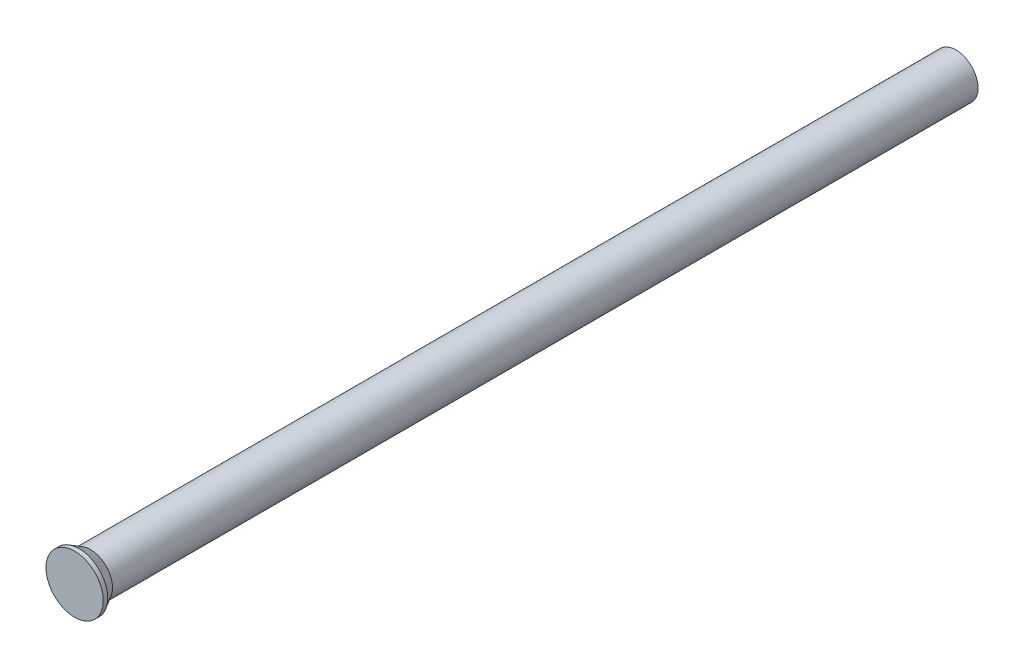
from build123d import *


with BuildPart() as part:
    # Sketch1 → Revolve1 (revolve)
    with BuildSketch(Plane(origin=(0, -18, -1.35), x_dir=(0, 0, -1), z_dir=(1, 0, 0)), mode=Mode.PRIVATE) as revolve1_sk:
        Polygon((-1.35, 18), (-1.35, 21.25), (-0.849038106, 21.25), (0.45, 20.5), (98.65, 20.5), (98.65, 18), align=None)
    revolve(revolve1_sk.sketch.rotate(Axis((0, 0, 0), (0, 0, 1)), 90), axis=Axis((0, 0, 0), (0, 0, 1)))


solid = part.part
